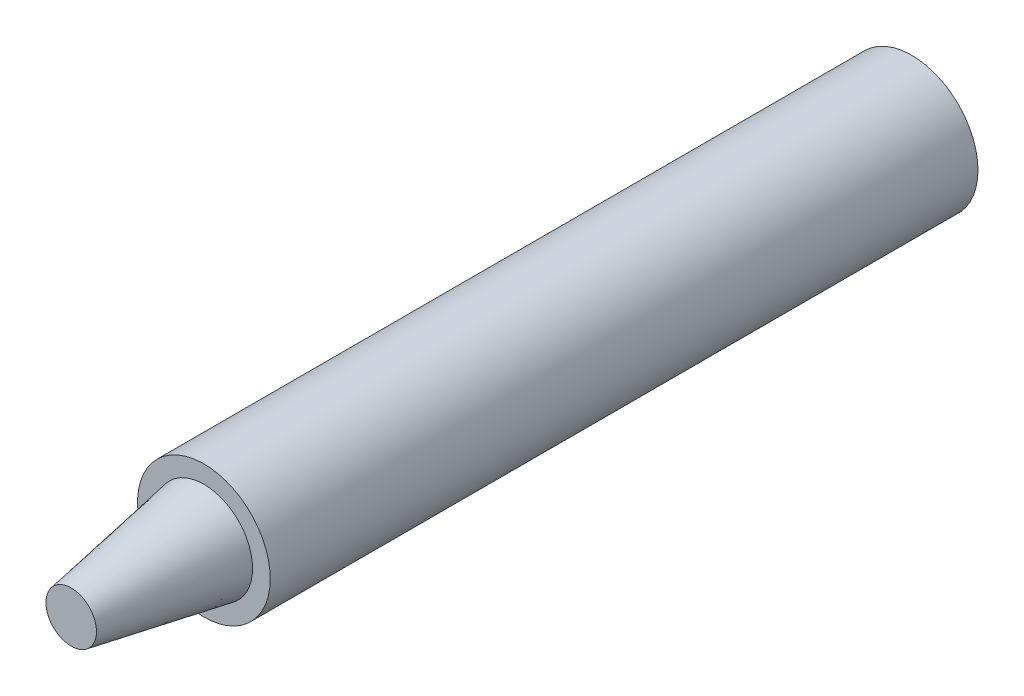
ISO-10303-21;
HEADER;
FILE_DESCRIPTION(('STEP AP214'),'2;1');
FILE_NAME('part.step','',(''),(''),'','','');
FILE_SCHEMA(('AUTOMOTIVE_DESIGN { 1 0 10303 214 1 1 1 1 }'));
ENDSEC;
DATA;
#1=APPLICATION_CONTEXT('core data for automotive mechanical design processes');
#2=APPLICATION_PROTOCOL_DEFINITION('international standard','automotive_design',2000,#1);
#3=PRODUCT_CONTEXT('',#1,'mechanical');
#4=PRODUCT('Part','Part','',(#3));
#5=PRODUCT_RELATED_PRODUCT_CATEGORY('part','',(#4));
#6=PRODUCT_DEFINITION_FORMATION('','',#4);
#7=PRODUCT_DEFINITION_CONTEXT('part definition',#1,'design');
#8=PRODUCT_DEFINITION('design','',#6,#7);
#9=PRODUCT_DEFINITION_SHAPE('','',#8);
#10=(LENGTH_UNIT() NAMED_UNIT(*) SI_UNIT(.MILLI.,.METRE.));
#11=(NAMED_UNIT(*) PLANE_ANGLE_UNIT() SI_UNIT($,.RADIAN.));
#12=(NAMED_UNIT(*) SI_UNIT($,.STERADIAN.) SOLID_ANGLE_UNIT());
#13=UNCERTAINTY_MEASURE_WITH_UNIT(LENGTH_MEASURE(1.E-05),#10,'distance_accuracy_value','');
#14=(GEOMETRIC_REPRESENTATION_CONTEXT(3) GLOBAL_UNCERTAINTY_ASSIGNED_CONTEXT((#13)) GLOBAL_UNIT_ASSIGNED_CONTEXT((#10,
#11,#12)) REPRESENTATION_CONTEXT('',''));
#15=CARTESIAN_POINT('',(0.,0.,0.));
#16=DIRECTION('',(0.,0.,1.));
#17=DIRECTION('',(1.,0.,0.));
#18=AXIS2_PLACEMENT_3D('',#15,#16,#17);
#19=CARTESIAN_POINT('',(0.,0.,101.6));
#20=DIRECTION('',(0.,0.,1.));
#21=DIRECTION('',(1.,0.,0.));
#22=AXIS2_PLACEMENT_3D('',#19,#20,#21);
#23=PLANE('',#22);
#24=CARTESIAN_POINT('',(0.,0.,101.6));
#25=DIRECTION('',(0.,0.,1.));
#26=DIRECTION('',(1.,0.,0.));
#27=AXIS2_PLACEMENT_3D('',#24,#25,#26);
#28=CIRCLE('',#27,9.525);
#29=CARTESIAN_POINT('',(9.525,0.,101.6));
#30=VERTEX_POINT('',#29);
#31=EDGE_CURVE('E10',#30,#30,#28,.T.);
#32=ORIENTED_EDGE('',*,*,#31,.T.);
#33=EDGE_LOOP('',(#32));
#34=FACE_BOUND('',#33,.T.);
#35=CARTESIAN_POINT('',(0.,0.,101.6));
#36=DIRECTION('',(0.,0.,1.));
#37=DIRECTION('',(1.,0.,0.));
#38=AXIS2_PLACEMENT_3D('',#35,#36,#37);
#39=CIRCLE('',#38,6.985);
#40=CARTESIAN_POINT('',(6.985,0.,101.6));
#41=VERTEX_POINT('',#40);
#42=EDGE_CURVE('E56',#41,#41,#39,.T.);
#43=ORIENTED_EDGE('',*,*,#42,.F.);
#44=EDGE_LOOP('',(#43));
#45=FACE_BOUND('',#44,.T.);
#46=ADVANCED_FACE('F41',(#34,#45),#23,.T.);
#47=CARTESIAN_POINT('',(0.,0.,101.6));
#48=DIRECTION('',(0.,0.,-1.));
#49=DIRECTION('',(-1.,0.,0.));
#50=AXIS2_PLACEMENT_3D('',#47,#48,#49);
#51=CYLINDRICAL_SURFACE('',#50,9.525);
#52=ORIENTED_EDGE('',*,*,#31,.F.);
#53=EDGE_LOOP('',(#52));
#54=FACE_BOUND('',#53,.T.);
#55=CARTESIAN_POINT('',(0.,0.,0.));
#56=DIRECTION('',(0.,0.,1.));
#57=DIRECTION('',(1.,0.,0.));
#58=AXIS2_PLACEMENT_3D('',#55,#56,#57);
#59=CIRCLE('',#58,9.525);
#60=CARTESIAN_POINT('',(9.525,0.,0.));
#61=VERTEX_POINT('',#60);
#62=EDGE_CURVE('E45',#61,#61,#59,.T.);
#63=ORIENTED_EDGE('',*,*,#62,.T.);
#64=EDGE_LOOP('',(#63));
#65=FACE_BOUND('',#64,.T.);
#66=ADVANCED_FACE('F43',(#54,#65),#51,.T.);
#67=CARTESIAN_POINT('',(0.,0.,0.));
#68=DIRECTION('',(0.,0.,1.));
#69=DIRECTION('',(1.,0.,0.));
#70=AXIS2_PLACEMENT_3D('',#67,#68,#69);
#71=PLANE('',#70);
#72=ORIENTED_EDGE('',*,*,#62,.F.);
#73=EDGE_LOOP('',(#72));
#74=FACE_BOUND('',#73,.T.);
#75=ADVANCED_FACE('F67',(#74),#71,.F.);
#76=CARTESIAN_POINT('',(0.,0.,101.6));
#77=DIRECTION('',(0.,0.,-1.));
#78=DIRECTION('',(1.,0.,0.));
#79=AXIS2_PLACEMENT_3D('',#76,#77,#78);
#80=CONICAL_SURFACE('',#79,6.985,0.174532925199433);
#81=CARTESIAN_POINT('',(0.,0.,120.65));
#82=DIRECTION('',(0.,0.,1.));
#83=DIRECTION('',(1.,0.,0.));
#84=AXIS2_PLACEMENT_3D('',#81,#82,#83);
#85=CIRCLE('',#84,3.62597101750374);
#86=CARTESIAN_POINT('',(3.62597101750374,0.,120.65));
#87=VERTEX_POINT('',#86);
#88=EDGE_CURVE('E52',#87,#87,#85,.T.);
#89=ORIENTED_EDGE('',*,*,#88,.F.);
#90=EDGE_LOOP('',(#89));
#91=FACE_BOUND('',#90,.T.);
#92=ORIENTED_EDGE('',*,*,#42,.T.);
#93=EDGE_LOOP('',(#92));
#94=FACE_BOUND('',#93,.T.);
#95=ADVANCED_FACE('F60',(#91,#94),#80,.T.);
#96=CARTESIAN_POINT('',(0.,0.,120.65));
#97=DIRECTION('',(0.,0.,1.));
#98=DIRECTION('',(1.,0.,0.));
#99=AXIS2_PLACEMENT_3D('',#96,#97,#98);
#100=PLANE('',#99);
#101=ORIENTED_EDGE('',*,*,#88,.T.);
#102=EDGE_LOOP('',(#101));
#103=FACE_BOUND('',#102,.T.);
#104=ADVANCED_FACE('F76',(#103),#100,.T.);
#105=CLOSED_SHELL('',(#46,#66,#75,#95,#104));
#106=MANIFOLD_SOLID_BREP('B2',#105);
#107=ADVANCED_BREP_SHAPE_REPRESENTATION('',(#18,#106),#14);
#108=SHAPE_DEFINITION_REPRESENTATION(#9,#107);
ENDSEC;
END-ISO-10303-21;
